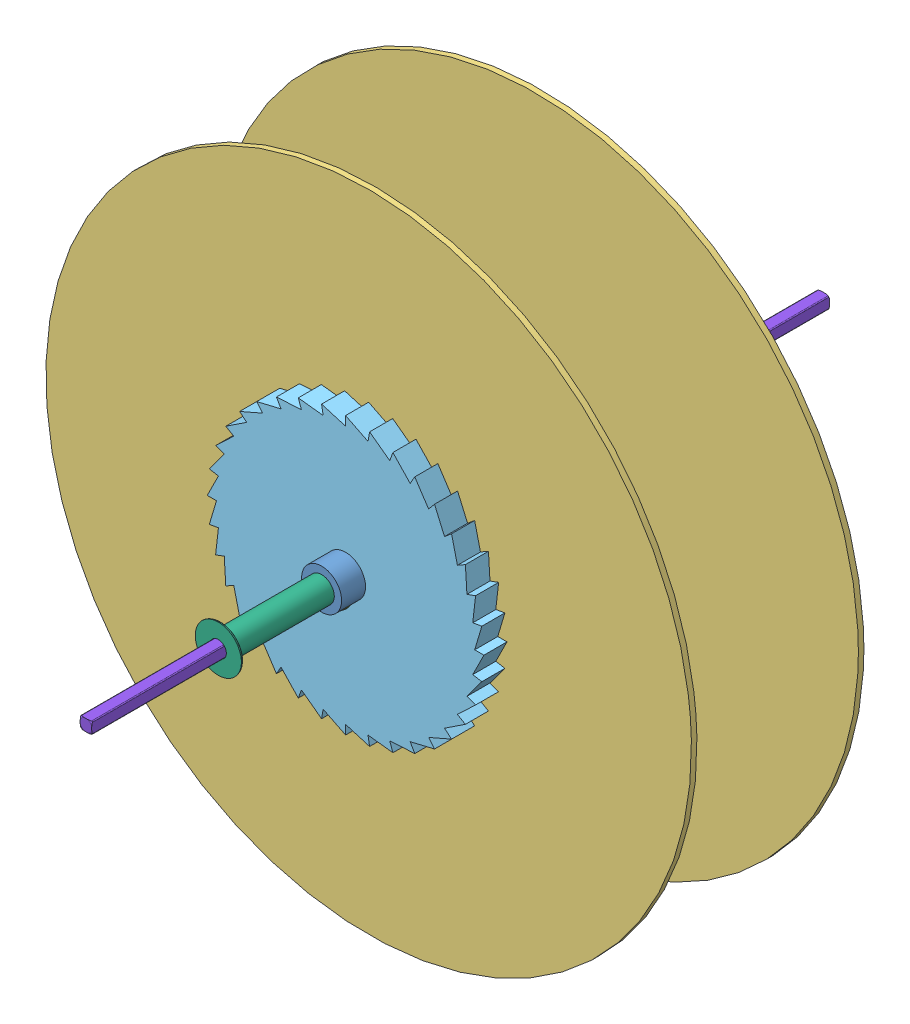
SolidWorks assembly Class Project Small Wheel.SLDASM, configuration Default (file format 10000). Lengths in mm.
Overall size (191.41 191.41 203.41).
12 component instances, 8 part files, 24 mates.
Components (placement in the parent):
- Shaft Collar-1: Shaft Collar.SLDPRT [Default] at (115.6558 157.9632 272.6088) x (0.923728 0.383049 0) z (0 0 1) size (11 11.03 6.6)
- Small Spool clamp-1: Small Spool clamp.SLDPRT [Default] at (115.6558 157.9632 209.1088) size (101.6 101.6 12.7)
- Small Spool part1-1: Small Spool part1.SLDPRT [Default] at (115.6558 157.9632 261.4328) x (0.996817 0.079722 0) z (0 0 1) size (177.8 177.8 1.52)
- Small Spool part2-1: Small Spool part2.SLDPRT [Default] at (115.6558 157.9632 216.9828) size (50.8 50.8 44.45)
- Small Spool Rachet clamp-1: Small Spool Rachet clamp.SLDPRT [Default] at (115.6558 157.9632 269.3068) x (1 0 0) z (0 0 -1) size (76.2 76.2 12.7)
- Small Spool part1-2: Small Spool part1.SLDPRT [Default] at (115.6558 157.9632 215.4588) size (177.8 177.8 1.52)
- Shaft Collar-2: Shaft Collar.SLDPRT [Default] at (115.6558 157.9632 205.8068) x (-0.923728 -0.383049 0) z (0 0 -1) size (11 11.03 6.6)
- Small wheel spacer-1: Small wheel spacer.SLDPRT [Default] at (115.6558 157.9632 275.9108) size (12.7 12.7 28.45)
- Small wheel spacer-2: Small wheel spacer.SLDPRT [Default] at (115.6558 157.9632 202.5048) x (-0.923728 -0.383049 0) z (0 0 -1) size (12.7 12.7 28.45)
- Vex Set Screw-1: Vex Set Screw.SLDPRT [91375A188] at (117.2858 154.0324 272.6088) x (0.857091 0.355416 0.372928) z (0.383049 -0.923728 0) size (4.19 4.24 3.49)
- Vex Set Screw-2: Vex Set Screw.SLDPRT [91375A188] at (117.2858 154.0324 205.8068) x (0.905943 0.375674 -0.195284) z (0.383049 -0.923728 0) size (4.19 4.24 3.49)
- Shaft 8in-1: Shaft 8in.SLDPRT [Default] at (115.6558 157.9632 188.4078) size (4.18 4.18 203.41)
Mates (geometry in assembly coordinates):
- Coincident1: coincident anti-aligned: plane of Small Spool clamp-1 through (115.6558 157.9632 215.4588) normal (0 0 1); plane of Small Spool part1-2 through (115.6558 157.9632 215.4588) normal (0 0 -1)
- Concentric1: concentric aligned: cylinder of Small Spool clamp-1 through (115.6558 157.9632 221.8088) axis (0 0 -1) radius 25.4; cylinder of Small Spool part1-2 through (115.6558 157.9632 216.9828) axis (0 0 -1) radius 88.9
- Coincident2: coincident anti-aligned: plane of Small Spool part2-1 through (115.6558 157.9632 216.9828) normal (0 0 -1); plane of Small Spool part1-2 through (115.6558 157.9632 216.9828) normal (0 0 1)
- Concentric2: concentric aligned: circle of Small Spool part2-1; circle of Small Spool part1-2
- Coincident3: coincident anti-aligned: plane of Small Spool part1-1 through (115.6558 157.9632 261.4328) normal (0 0 -1); plane of Small Spool part2-1 through (115.6558 157.9632 261.4328) normal (0 0 1)
- Concentric3: concentric aligned: cylinder of Small Spool part1-1 through (115.6558 157.9632 262.9568) axis (0 0 -1) radius 88.9; cylinder of Small Spool part1-2 through (115.6558 157.9632 216.9828) axis (0 0 -1) radius 88.9
- Concentric4: concentric anti-aligned: circle of Small Spool Rachet clamp-1; circle of Small Spool part1-2
- Coincident4: coincident anti-aligned: plane of Small Spool part1-1 through (115.6558 157.9632 262.9568) normal (0 0 1); plane of Small Spool Rachet clamp-1 through (115.6558 157.9632 262.9568) normal (0 0 -1)
- Coincident5: coincident anti-aligned: plane of Small Spool clamp-1 through (115.6558 157.9632 209.1088) normal (0 0 -1); plane of Shaft Collar-2 through (115.6558 157.9632 209.1088) normal (0 0 1)
- Concentric5: concentric aligned: cylinder of Small Spool part1-2 through (115.6558 157.9632 216.9828) axis (0 0 -1) radius 88.9; cylinder of Shaft Collar-2 through (115.6558 157.9632 209.1088) axis (0 0 -1) radius 5.5
- Coincident6: coincident anti-aligned: plane of Shaft Collar-1 through (115.6558 157.9632 269.3068) normal (0 0 -1); plane of Small Spool Rachet clamp-1 through (115.6558 157.9632 269.3068) normal (0 0 1)
- Concentric6: concentric aligned: cylinder of Shaft Collar-1 through (115.6558 157.9632 269.3068) axis (0 0 1) radius 5.5; circle of Small Spool part1-2
- Coincident8: coincident anti-aligned: plane of Shaft Collar-2 through (115.6558 157.9632 202.5048) normal (0 0 -1); plane of Small wheel spacer-2 through (115.6558 157.9632 202.5048) normal (0 0 1)
- Concentric8: concentric anti-aligned: cylinder of Small Spool clamp-1 through (115.6558 157.9632 215.4588) axis (0 0 -1) radius 50.8; cylinder of Small wheel spacer-2 through (115.6558 157.9632 174.0568) axis (0 0 1) radius 3.4925
- Tangent1: tangent aligned: cylinder of Shaft Collar-1 through (115.6558 157.9632 269.3068) axis (0 0 1) radius 5.5; plane of Vex Set Screw-1 through (117.7626 152.8827 272.6088) normal (0.383049 -0.923728 0)
- Concentric9: concentric anti-aligned: cylinder of Shaft Collar-1 through (115.6558 157.9632 272.6088) axis (-0.383049 0.923728 0) radius 2.0828; cylinder of Vex Set Screw-1 through (116.8091 155.1821 272.6088) axis (0.383049 -0.923728 0) radius 2.0828
- Tangent2: tangent aligned: cylinder of Shaft Collar-2 through (115.6558 157.9632 209.1088) axis (0 0 -1) radius 5.5; plane of Vex Set Screw-2 through (117.7626 152.8827 205.8068) normal (0.383049 -0.923728 0)
- Concentric10: concentric anti-aligned: cylinder of Shaft Collar-2 through (115.6558 157.9632 205.8068) axis (-0.383049 0.923728 0) radius 2.0828; cylinder of Vex Set Screw-2 through (116.8091 155.1821 205.8068) axis (0.383049 -0.923728 0) radius 2.0828
- Parallel1: parallel aligned: plane of Vex Set Screw-1 through (117.7626 152.8827 272.6088) normal (0.383049 -0.923728 0); plane of Vex Set Screw-2 through (117.7626 152.8827 205.8068) normal (0.383049 -0.923728 0)
- Coincident9: coincident anti-aligned: plane of Shaft Collar-1 through (115.6558 157.9632 275.9108) normal (0 0 1); plane of Small wheel spacer-1 through (115.6558 157.9632 275.9108) normal (0 0 -1)
- Concentric12: concentric anti-aligned: cylinder of Shaft Collar-1 through (115.6558 157.9632 269.3068) axis (0 0 1) radius 5.5; cylinder of Small wheel spacer-1 through (115.6558 157.9632 304.3588) axis (0 0 -1) radius 3.4925
- Width1: width: plane of Shaft 8in-1 through (117.2433 156.3757 340.8078) normal (1 0 0); plane of Shaft 8in-1 through (114.0683 156.3757 340.8078) normal (-1 0 0); cylinder of Small wheel spacer-1 through (115.6558 157.9632 304.3588) axis (0 0 -1) radius 3.4925
- Width2: width: plane of Shaft 8in-1 through (114.0683 159.5507 340.8078) normal (0 1 0); plane of Shaft 8in-1 through (114.0683 156.3757 340.8078) normal (0 -1 0); cylinder of Small wheel spacer-1 through (115.6558 157.9632 304.3588) axis (0 0 -1) radius 3.4925
- Width3: width anti-aligned: plane of Shaft 8in-1 through (114.0683 159.5507 340.8078) normal (0 0 1); plane of Shaft 8in-1 through (114.0683 159.5507 137.6078) normal (0 0 -1); plane of Small Spool part1-2 through (115.6558 157.9632 215.4588) normal (0 0 -1); plane of Small Spool part1-1 through (115.6558 157.9632 262.9568) normal (0 0 1)
